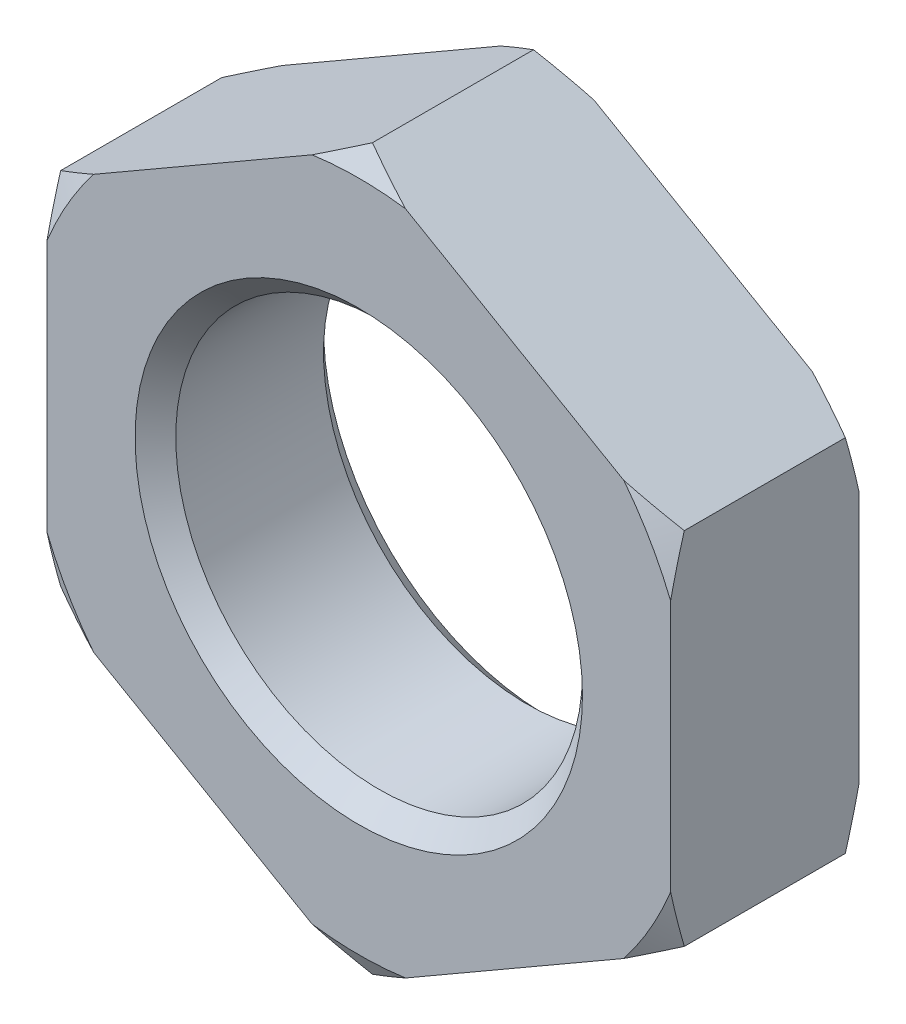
from build123d import *

# Parameters (mm, degrees)
SKETCH1_R           = 15
BOSS_EXTRUDE1_DEPTH = 6.95
CHAMFER1_SIZE       = 1.5


with BuildPart() as part:
    # Sketch1 → Boss-Extrude1 (new, symmetric)
    with BuildSketch(Plane.XY):
        Polygon((0, 26.558112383), (-23, 13.279056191), (-23, -13.279056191), (0, -26.558112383), (23, -13.279056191), (23, 13.279056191), align=None)
        Circle(SKETCH1_R, mode=Mode.SUBTRACT)
    extrude(amount=BOSS_EXTRUDE1_DEPTH, both=True)

    # Sketch3 → Cut-Revolve1 (revolve, cut)
    with BuildSketch(Plane(origin=(0, 0, 0), x_dir=(0, 0, -1), z_dir=(1, 0, 0))):
        Polygon((-6.95, 26.558112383), (-6.95, 24.808112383), (-5.939637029, 26.558112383), align=None)
    cut_revolve1 = revolve(axis=Axis((0, 0, -7.477018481), (0, 0, 1)), mode=Mode.SUBTRACT)

    # Mirror1: Cut-Revolve1 across plane
    add(cut_revolve1.mirror(Plane.XY), mode=Mode.SUBTRACT)

    # Chamfer1
    chamfer1_edges = [part.edges().sort_by_distance(p)[0] for p in [
        (-15, 0, -6.95),
        (-15, 0, 6.95),
    ]]
    chamfer(chamfer1_edges, length=CHAMFER1_SIZE)


solid = part.part
